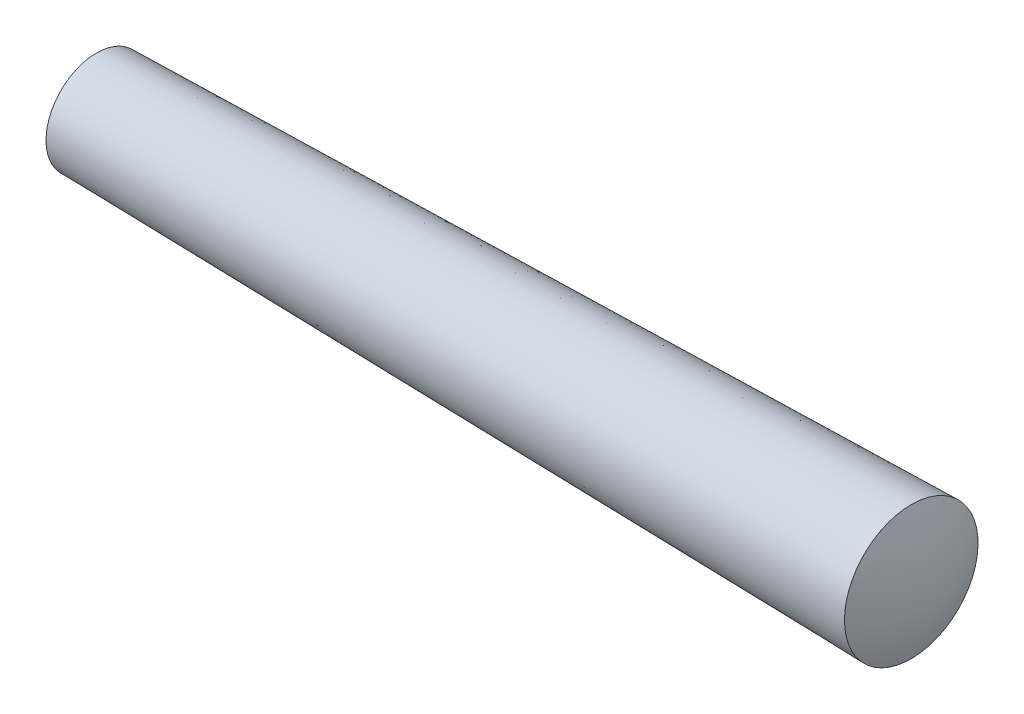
from build123d import *


with BuildPart() as part:
    # Sketch1 → Base-Revolve (revolve)
    with BuildSketch(Plane.XY):
        with BuildLine():
            Line((0, 0), (5, 0))
            ThreePointArc((5, 0), (4.97980079, 0.202392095), (4.92, 0.3968))
            Line((4.92, 0.3968), (0.08, 0.3))
            ThreePointArc((0.08, 0.3), (0.020343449, 0.155241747), (0, 0))
        make_face()
    revolve(axis=Axis((-4.003548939, 0, 0), (1, 0, 0)))


solid = part.part
